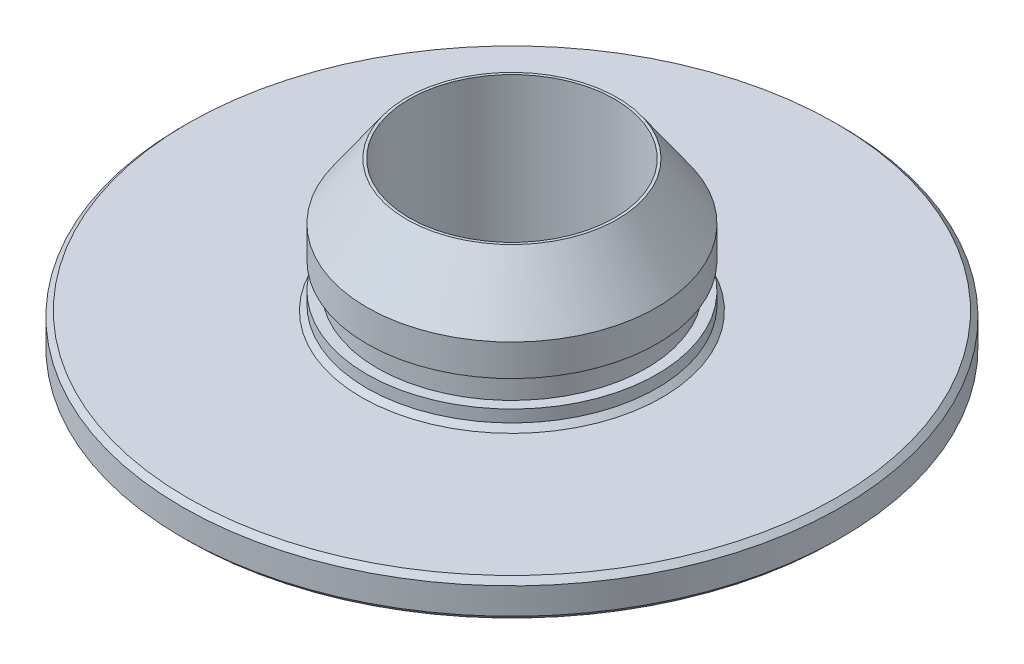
ISO-10303-21;
HEADER;
FILE_DESCRIPTION(('STEP AP214'),'2;1');
FILE_NAME('part.step','',(''),(''),'','','');
FILE_SCHEMA(('AUTOMOTIVE_DESIGN { 1 0 10303 214 1 1 1 1 }'));
ENDSEC;
DATA;
#1=APPLICATION_CONTEXT('core data for automotive mechanical design processes');
#2=APPLICATION_PROTOCOL_DEFINITION('international standard','automotive_design',2000,#1);
#3=PRODUCT_CONTEXT('',#1,'mechanical');
#4=PRODUCT('Part','Part','',(#3));
#5=PRODUCT_RELATED_PRODUCT_CATEGORY('part','',(#4));
#6=PRODUCT_DEFINITION_FORMATION('','',#4);
#7=PRODUCT_DEFINITION_CONTEXT('part definition',#1,'design');
#8=PRODUCT_DEFINITION('design','',#6,#7);
#9=PRODUCT_DEFINITION_SHAPE('','',#8);
#10=(LENGTH_UNIT() NAMED_UNIT(*) SI_UNIT(.MILLI.,.METRE.));
#11=(NAMED_UNIT(*) PLANE_ANGLE_UNIT() SI_UNIT($,.RADIAN.));
#12=(NAMED_UNIT(*) SI_UNIT($,.STERADIAN.) SOLID_ANGLE_UNIT());
#13=UNCERTAINTY_MEASURE_WITH_UNIT(LENGTH_MEASURE(1.E-05),#10,'distance_accuracy_value','');
#14=(GEOMETRIC_REPRESENTATION_CONTEXT(3) GLOBAL_UNCERTAINTY_ASSIGNED_CONTEXT((#13)) GLOBAL_UNIT_ASSIGNED_CONTEXT((#10,
#11,#12)) REPRESENTATION_CONTEXT('',''));
#15=CARTESIAN_POINT('',(0.,0.,0.));
#16=DIRECTION('',(0.,0.,1.));
#17=DIRECTION('',(1.,0.,0.));
#18=AXIS2_PLACEMENT_3D('',#15,#16,#17);
#19=CARTESIAN_POINT('',(0.,1.905,0.));
#20=DIRECTION('',(0.,1.,0.));
#21=DIRECTION('',(0.,0.,1.));
#22=AXIS2_PLACEMENT_3D('',#19,#20,#21);
#23=PLANE('',#22);
#24=CARTESIAN_POINT('',(0.,1.905,0.));
#25=DIRECTION('',(0.,1.,0.));
#26=DIRECTION('',(0.,0.,1.));
#27=AXIS2_PLACEMENT_3D('',#24,#25,#26);
#28=CIRCLE('',#27,3.6195);
#29=CARTESIAN_POINT('',(0.,1.905,3.6195));
#30=VERTEX_POINT('',#29);
#31=EDGE_CURVE('E59',#30,#30,#28,.F.);
#32=ORIENTED_EDGE('',*,*,#31,.T.);
#33=EDGE_LOOP('',(#32));
#34=FACE_BOUND('',#33,.T.);
#35=CARTESIAN_POINT('',(0.,1.905,0.));
#36=DIRECTION('',(0.,1.,0.));
#37=DIRECTION('',(0.,0.,1.));
#38=AXIS2_PLACEMENT_3D('',#35,#36,#37);
#39=CIRCLE('',#38,7.8105);
#40=CARTESIAN_POINT('',(0.,1.905,7.8105));
#41=VERTEX_POINT('',#40);
#42=EDGE_CURVE('E62',#41,#41,#39,.T.);
#43=ORIENTED_EDGE('',*,*,#42,.T.);
#44=EDGE_LOOP('',(#43));
#45=FACE_BOUND('',#44,.T.);
#46=ADVANCED_FACE('F24',(#34,#45),#23,.T.);
#47=CARTESIAN_POINT('',(0.,1.016,0.));
#48=DIRECTION('',(0.,-1.,0.));
#49=DIRECTION('',(0.,0.,-1.));
#50=AXIS2_PLACEMENT_3D('',#47,#48,#49);
#51=CYLINDRICAL_SURFACE('',#50,4.445);
#52=CARTESIAN_POINT('',(0.,0.889000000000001,0.));
#53=DIRECTION('',(0.,1.,0.));
#54=DIRECTION('',(0.,0.,1.));
#55=AXIS2_PLACEMENT_3D('',#52,#53,#54);
#56=CIRCLE('',#55,4.445);
#57=CARTESIAN_POINT('',(0.,0.889000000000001,4.445));
#58=VERTEX_POINT('',#57);
#59=EDGE_CURVE('E39',#58,#58,#56,.F.);
#60=ORIENTED_EDGE('',*,*,#59,.T.);
#61=EDGE_LOOP('',(#60));
#62=FACE_BOUND('',#61,.T.);
#63=CARTESIAN_POINT('',(0.,0.127,0.));
#64=DIRECTION('',(0.,1.,0.));
#65=DIRECTION('',(0.,0.,1.));
#66=AXIS2_PLACEMENT_3D('',#63,#64,#65);
#67=CIRCLE('',#66,4.445);
#68=CARTESIAN_POINT('',(0.,0.127,4.445));
#69=VERTEX_POINT('',#68);
#70=EDGE_CURVE('E44',#69,#69,#67,.T.);
#71=ORIENTED_EDGE('',*,*,#70,.T.);
#72=EDGE_LOOP('',(#71));
#73=FACE_BOUND('',#72,.T.);
#74=ADVANCED_FACE('F26',(#62,#73),#51,.T.);
#75=CARTESIAN_POINT('',(0.,0.,0.));
#76=DIRECTION('',(0.,1.,0.));
#77=DIRECTION('',(0.,0.,1.));
#78=AXIS2_PLACEMENT_3D('',#75,#76,#77);
#79=PLANE('',#78);
#80=CARTESIAN_POINT('',(0.,0.,0.));
#81=DIRECTION('',(0.,1.,0.));
#82=DIRECTION('',(0.,0.,1.));
#83=AXIS2_PLACEMENT_3D('',#80,#81,#82);
#84=CIRCLE('',#83,4.318);
#85=CARTESIAN_POINT('',(0.,0.,4.318));
#86=VERTEX_POINT('',#85);
#87=EDGE_CURVE('E31',#86,#86,#84,.F.);
#88=ORIENTED_EDGE('',*,*,#87,.T.);
#89=EDGE_LOOP('',(#88));
#90=FACE_BOUND('',#89,.T.);
#91=CARTESIAN_POINT('',(0.,0.,0.));
#92=DIRECTION('',(0.,1.,0.));
#93=DIRECTION('',(0.,0.,1.));
#94=AXIS2_PLACEMENT_3D('',#91,#92,#93);
#95=CIRCLE('',#94,2.6035);
#96=CARTESIAN_POINT('',(0.,0.,2.6035));
#97=VERTEX_POINT('',#96);
#98=EDGE_CURVE('E35',#97,#97,#95,.T.);
#99=ORIENTED_EDGE('',*,*,#98,.T.);
#100=EDGE_LOOP('',(#99));
#101=FACE_BOUND('',#100,.T.);
#102=ADVANCED_FACE('F126',(#90,#101),#79,.F.);
#103=CARTESIAN_POINT('',(0.,1.016,0.));
#104=DIRECTION('',(0.,1.,0.));
#105=DIRECTION('',(0.,0.,1.));
#106=AXIS2_PLACEMENT_3D('',#103,#104,#105);
#107=PLANE('',#106);
#108=CARTESIAN_POINT('',(0.,1.016,0.));
#109=DIRECTION('',(0.,1.,0.));
#110=DIRECTION('',(0.,0.,1.));
#111=AXIS2_PLACEMENT_3D('',#108,#109,#110);
#112=CIRCLE('',#111,7.8105);
#113=CARTESIAN_POINT('',(0.,1.016,7.8105));
#114=VERTEX_POINT('',#113);
#115=EDGE_CURVE('E47',#114,#114,#112,.F.);
#116=ORIENTED_EDGE('',*,*,#115,.T.);
#117=EDGE_LOOP('',(#116));
#118=FACE_BOUND('',#117,.T.);
#119=CARTESIAN_POINT('',(0.,1.016,0.));
#120=DIRECTION('',(0.,1.,0.));
#121=DIRECTION('',(0.,0.,1.));
#122=AXIS2_PLACEMENT_3D('',#119,#120,#121);
#123=CIRCLE('',#122,4.572);
#124=CARTESIAN_POINT('',(0.,1.016,4.572));
#125=VERTEX_POINT('',#124);
#126=EDGE_CURVE('E50',#125,#125,#123,.T.);
#127=ORIENTED_EDGE('',*,*,#126,.T.);
#128=EDGE_LOOP('',(#127));
#129=FACE_BOUND('',#128,.T.);
#130=ADVANCED_FACE('F130',(#118,#129),#107,.F.);
#131=CARTESIAN_POINT('',(0.,1.905,0.));
#132=DIRECTION('',(0.,-1.,0.));
#133=DIRECTION('',(0.,0.,-1.));
#134=AXIS2_PLACEMENT_3D('',#131,#132,#133);
#135=CYLINDRICAL_SURFACE('',#134,7.9375);
#136=CARTESIAN_POINT('',(0.,1.778,0.));
#137=DIRECTION('',(0.,1.,0.));
#138=DIRECTION('',(0.,0.,1.));
#139=AXIS2_PLACEMENT_3D('',#136,#137,#138);
#140=CIRCLE('',#139,7.9375);
#141=CARTESIAN_POINT('',(0.,1.778,7.9375));
#142=VERTEX_POINT('',#141);
#143=EDGE_CURVE('E53',#142,#142,#140,.F.);
#144=ORIENTED_EDGE('',*,*,#143,.T.);
#145=EDGE_LOOP('',(#144));
#146=FACE_BOUND('',#145,.T.);
#147=CARTESIAN_POINT('',(0.,1.143,0.));
#148=DIRECTION('',(0.,1.,0.));
#149=DIRECTION('',(0.,0.,1.));
#150=AXIS2_PLACEMENT_3D('',#147,#148,#149);
#151=CIRCLE('',#150,7.9375);
#152=CARTESIAN_POINT('',(0.,1.143,7.9375));
#153=VERTEX_POINT('',#152);
#154=EDGE_CURVE('E56',#153,#153,#151,.T.);
#155=ORIENTED_EDGE('',*,*,#154,.T.);
#156=EDGE_LOOP('',(#155));
#157=FACE_BOUND('',#156,.T.);
#158=ADVANCED_FACE('F118',(#146,#157),#135,.T.);
#159=CARTESIAN_POINT('',(0.,5.08,0.));
#160=DIRECTION('',(0.,-1.,0.));
#161=DIRECTION('',(0.,0.,-1.));
#162=AXIS2_PLACEMENT_3D('',#159,#160,#161);
#163=CYLINDRICAL_SURFACE('',#162,3.4925);
#164=CARTESIAN_POINT('',(0.,2.032,0.));
#165=DIRECTION('',(0.,1.,0.));
#166=DIRECTION('',(0.,0.,1.));
#167=AXIS2_PLACEMENT_3D('',#164,#165,#166);
#168=CIRCLE('',#167,3.4925);
#169=CARTESIAN_POINT('',(0.,2.032,3.4925));
#170=VERTEX_POINT('',#169);
#171=EDGE_CURVE('E65',#170,#170,#168,.T.);
#172=ORIENTED_EDGE('',*,*,#171,.T.);
#173=EDGE_LOOP('',(#172));
#174=FACE_BOUND('',#173,.T.);
#175=CARTESIAN_POINT('',(0.,2.32268902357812,0.));
#176=DIRECTION('',(0.,1.,0.));
#177=DIRECTION('',(0.,0.,1.));
#178=AXIS2_PLACEMENT_3D('',#175,#176,#177);
#179=CIRCLE('',#178,3.4925);
#180=CARTESIAN_POINT('',(0.,2.32268902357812,3.4925));
#181=VERTEX_POINT('',#180);
#182=EDGE_CURVE('E80',#181,#181,#179,.T.);
#183=ORIENTED_EDGE('',*,*,#182,.F.);
#184=EDGE_LOOP('',(#183));
#185=FACE_BOUND('',#184,.T.);
#186=ADVANCED_FACE('F109',(#174,#185),#163,.T.);
#187=CARTESIAN_POINT('',(-3.2385,2.95768902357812,0.));
#188=DIRECTION('',(0.,1.,0.));
#189=DIRECTION('',(0.,0.,1.));
#190=AXIS2_PLACEMENT_3D('',#187,#188,#189);
#191=PLANE('',#190);
#192=CARTESIAN_POINT('',(0.,2.95768902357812,0.));
#193=DIRECTION('',(0.,1.,0.));
#194=DIRECTION('',(0.,0.,1.));
#195=AXIS2_PLACEMENT_3D('',#192,#193,#194);
#196=CIRCLE('',#195,3.4925);
#197=CARTESIAN_POINT('',(0.,2.95768902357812,3.4925));
#198=VERTEX_POINT('',#197);
#199=EDGE_CURVE('E83',#198,#198,#196,.T.);
#200=ORIENTED_EDGE('',*,*,#199,.F.);
#201=EDGE_LOOP('',(#200));
#202=FACE_BOUND('',#201,.T.);
#203=CARTESIAN_POINT('',(0.,2.95768902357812,0.));
#204=DIRECTION('',(0.,1.,0.));
#205=DIRECTION('',(0.,0.,1.));
#206=AXIS2_PLACEMENT_3D('',#203,#204,#205);
#207=CIRCLE('',#206,3.2385);
#208=CARTESIAN_POINT('',(0.,2.95768902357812,3.2385));
#209=VERTEX_POINT('',#208);
#210=EDGE_CURVE('E74',#209,#209,#207,.T.);
#211=ORIENTED_EDGE('',*,*,#210,.T.);
#212=EDGE_LOOP('',(#211));
#213=FACE_BOUND('',#212,.T.);
#214=ADVANCED_FACE('F117',(#202,#213),#191,.F.);
#215=CARTESIAN_POINT('',(0.,5.08,0.));
#216=DIRECTION('',(0.,1.,0.));
#217=DIRECTION('',(0.,0.,1.));
#218=AXIS2_PLACEMENT_3D('',#215,#216,#217);
#219=CYLINDRICAL_SURFACE('',#218,3.2385);
#220=ORIENTED_EDGE('',*,*,#210,.F.);
#221=EDGE_LOOP('',(#220));
#222=FACE_BOUND('',#221,.T.);
#223=CARTESIAN_POINT('',(0.,2.32268902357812,0.));
#224=DIRECTION('',(0.,1.,0.));
#225=DIRECTION('',(0.,0.,1.));
#226=AXIS2_PLACEMENT_3D('',#223,#224,#225);
#227=CIRCLE('',#226,3.2385);
#228=CARTESIAN_POINT('',(0.,2.32268902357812,3.2385));
#229=VERTEX_POINT('',#228);
#230=EDGE_CURVE('E77',#229,#229,#227,.T.);
#231=ORIENTED_EDGE('',*,*,#230,.T.);
#232=EDGE_LOOP('',(#231));
#233=FACE_BOUND('',#232,.T.);
#234=ADVANCED_FACE('F169',(#222,#233),#219,.T.);
#235=CARTESIAN_POINT('',(-3.4925,2.32268902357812,0.));
#236=DIRECTION('',(0.,-1.,0.));
#237=DIRECTION('',(0.,0.,-1.));
#238=AXIS2_PLACEMENT_3D('',#235,#236,#237);
#239=PLANE('',#238);
#240=ORIENTED_EDGE('',*,*,#230,.F.);
#241=EDGE_LOOP('',(#240));
#242=FACE_BOUND('',#241,.T.);
#243=ORIENTED_EDGE('',*,*,#182,.T.);
#244=EDGE_LOOP('',(#243));
#245=FACE_BOUND('',#244,.T.);
#246=ADVANCED_FACE('F96',(#242,#245),#239,.F.);
#247=CARTESIAN_POINT('',(0.,5.08,0.));
#248=DIRECTION('',(0.,1.,0.));
#249=DIRECTION('',(0.,0.,1.));
#250=AXIS2_PLACEMENT_3D('',#247,#248,#249);
#251=PLANE('',#250);
#252=CARTESIAN_POINT('',(0.,5.08,0.));
#253=DIRECTION('',(0.,1.,0.));
#254=DIRECTION('',(0.,0.,1.));
#255=AXIS2_PLACEMENT_3D('',#252,#253,#254);
#256=CIRCLE('',#255,2.4765);
#257=CARTESIAN_POINT('',(0.,5.08,2.4765));
#258=VERTEX_POINT('',#257);
#259=EDGE_CURVE('E86',#258,#258,#256,.T.);
#260=ORIENTED_EDGE('',*,*,#259,.F.);
#261=EDGE_LOOP('',(#260));
#262=FACE_BOUND('',#261,.T.);
#263=CARTESIAN_POINT('',(0.,5.08,0.));
#264=DIRECTION('',(0.,1.,0.));
#265=DIRECTION('',(0.,0.,1.));
#266=AXIS2_PLACEMENT_3D('',#263,#264,#265);
#267=CIRCLE('',#266,2.54);
#268=CARTESIAN_POINT('',(0.,5.08,2.54));
#269=VERTEX_POINT('',#268);
#270=EDGE_CURVE('E71',#269,#269,#267,.T.);
#271=ORIENTED_EDGE('',*,*,#270,.T.);
#272=EDGE_LOOP('',(#271));
#273=FACE_BOUND('',#272,.T.);
#274=ADVANCED_FACE('F92',(#262,#273),#251,.T.);
#275=CARTESIAN_POINT('',(0.,3.71968902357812,0.));
#276=DIRECTION('',(0.,-1.,0.));
#277=DIRECTION('',(0.,0.,-1.));
#278=AXIS2_PLACEMENT_3D('',#275,#276,#277);
#279=CONICAL_SURFACE('',#278,3.4925,0.61086523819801);
#280=ORIENTED_EDGE('',*,*,#270,.F.);
#281=EDGE_LOOP('',(#280));
#282=FACE_BOUND('',#281,.T.);
#283=CARTESIAN_POINT('',(0.,3.71968902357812,0.));
#284=DIRECTION('',(0.,1.,0.));
#285=DIRECTION('',(0.,0.,1.));
#286=AXIS2_PLACEMENT_3D('',#283,#284,#285);
#287=CIRCLE('',#286,3.4925);
#288=CARTESIAN_POINT('',(0.,3.71968902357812,3.4925));
#289=VERTEX_POINT('',#288);
#290=EDGE_CURVE('E68',#289,#289,#287,.T.);
#291=ORIENTED_EDGE('',*,*,#290,.T.);
#292=EDGE_LOOP('',(#291));
#293=FACE_BOUND('',#292,.T.);
#294=ADVANCED_FACE('F95',(#282,#293),#279,.T.);
#295=ORIENTED_EDGE('',*,*,#199,.T.);
#296=EDGE_LOOP('',(#295));
#297=FACE_BOUND('',#296,.T.);
#298=ORIENTED_EDGE('',*,*,#290,.F.);
#299=EDGE_LOOP('',(#298));
#300=FACE_BOUND('',#299,.T.);
#301=ADVANCED_FACE('F102',(#297,#300),#163,.T.);
#302=CARTESIAN_POINT('',(0.,0.,0.));
#303=DIRECTION('',(0.,1.,0.));
#304=DIRECTION('',(0.,0.,1.));
#305=AXIS2_PLACEMENT_3D('',#302,#303,#304);
#306=CYLINDRICAL_SURFACE('',#305,2.4765);
#307=CARTESIAN_POINT('',(0.,0.127,0.));
#308=DIRECTION('',(0.,1.,0.));
#309=DIRECTION('',(0.,0.,1.));
#310=AXIS2_PLACEMENT_3D('',#307,#308,#309);
#311=CIRCLE('',#310,2.4765);
#312=CARTESIAN_POINT('',(0.,0.127,2.4765));
#313=VERTEX_POINT('',#312);
#314=EDGE_CURVE('E10',#313,#313,#311,.F.);
#315=ORIENTED_EDGE('',*,*,#314,.T.);
#316=EDGE_LOOP('',(#315));
#317=FACE_BOUND('',#316,.T.);
#318=ORIENTED_EDGE('',*,*,#259,.T.);
#319=EDGE_LOOP('',(#318));
#320=FACE_BOUND('',#319,.T.);
#321=ADVANCED_FACE('F90',(#317,#320),#306,.F.);
#322=CARTESIAN_POINT('',(0.,2.032,0.));
#323=DIRECTION('',(0.,-1.,0.));
#324=DIRECTION('',(0.,0.,-1.));
#325=AXIS2_PLACEMENT_3D('',#322,#323,#324);
#326=CONICAL_SURFACE('',#325,3.4925,0.785398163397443);
#327=ORIENTED_EDGE('',*,*,#31,.F.);
#328=EDGE_LOOP('',(#327));
#329=FACE_BOUND('',#328,.T.);
#330=ORIENTED_EDGE('',*,*,#171,.F.);
#331=EDGE_LOOP('',(#330));
#332=FACE_BOUND('',#331,.T.);
#333=ADVANCED_FACE('F113',(#329,#332),#326,.T.);
#334=CARTESIAN_POINT('',(0.,1.905,0.));
#335=DIRECTION('',(0.,-1.,0.));
#336=DIRECTION('',(0.,0.,-1.));
#337=AXIS2_PLACEMENT_3D('',#334,#335,#336);
#338=CONICAL_SURFACE('',#337,7.8105,0.785398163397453);
#339=ORIENTED_EDGE('',*,*,#143,.F.);
#340=EDGE_LOOP('',(#339));
#341=FACE_BOUND('',#340,.T.);
#342=ORIENTED_EDGE('',*,*,#42,.F.);
#343=EDGE_LOOP('',(#342));
#344=FACE_BOUND('',#343,.T.);
#345=ADVANCED_FACE('F159',(#341,#344),#338,.T.);
#346=CARTESIAN_POINT('',(0.,1.143,0.));
#347=DIRECTION('',(0.,1.,0.));
#348=DIRECTION('',(0.,0.,1.));
#349=AXIS2_PLACEMENT_3D('',#346,#347,#348);
#350=CONICAL_SURFACE('',#349,7.9375,0.785398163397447);
#351=ORIENTED_EDGE('',*,*,#115,.F.);
#352=EDGE_LOOP('',(#351));
#353=FACE_BOUND('',#352,.T.);
#354=ORIENTED_EDGE('',*,*,#154,.F.);
#355=EDGE_LOOP('',(#354));
#356=FACE_BOUND('',#355,.T.);
#357=ADVANCED_FACE('F155',(#353,#356),#350,.T.);
#358=CARTESIAN_POINT('',(0.,1.016,0.));
#359=DIRECTION('',(0.,1.,0.));
#360=DIRECTION('',(0.,0.,1.));
#361=AXIS2_PLACEMENT_3D('',#358,#359,#360);
#362=CONICAL_SURFACE('',#361,4.572,0.785398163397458);
#363=ORIENTED_EDGE('',*,*,#59,.F.);
#364=EDGE_LOOP('',(#363));
#365=FACE_BOUND('',#364,.T.);
#366=ORIENTED_EDGE('',*,*,#126,.F.);
#367=EDGE_LOOP('',(#366));
#368=FACE_BOUND('',#367,.T.);
#369=ADVANCED_FACE('F149',(#365,#368),#362,.T.);
#370=CARTESIAN_POINT('',(0.,0.127,0.));
#371=DIRECTION('',(0.,1.,0.));
#372=DIRECTION('',(0.,0.,1.));
#373=AXIS2_PLACEMENT_3D('',#370,#371,#372);
#374=CONICAL_SURFACE('',#373,4.445,0.785398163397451);
#375=ORIENTED_EDGE('',*,*,#87,.F.);
#376=EDGE_LOOP('',(#375));
#377=FACE_BOUND('',#376,.T.);
#378=ORIENTED_EDGE('',*,*,#70,.F.);
#379=EDGE_LOOP('',(#378));
#380=FACE_BOUND('',#379,.T.);
#381=ADVANCED_FACE('F143',(#377,#380),#374,.T.);
#382=CARTESIAN_POINT('',(0.,0.,0.));
#383=DIRECTION('',(0.,-1.,0.));
#384=DIRECTION('',(0.,0.,-1.));
#385=AXIS2_PLACEMENT_3D('',#382,#383,#384);
#386=CONICAL_SURFACE('',#385,2.6035,0.785398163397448);
#387=ORIENTED_EDGE('',*,*,#314,.F.);
#388=EDGE_LOOP('',(#387));
#389=FACE_BOUND('',#388,.T.);
#390=ORIENTED_EDGE('',*,*,#98,.F.);
#391=EDGE_LOOP('',(#390));
#392=FACE_BOUND('',#391,.T.);
#393=ADVANCED_FACE('F141',(#389,#392),#386,.F.);
#394=CLOSED_SHELL('',(#46,#74,#102,#130,#158,#186,#214,#234,#246,#274,#294,#301,#321,#333,#345,
#357,#369,#381,#393));
#395=MANIFOLD_SOLID_BREP('B2',#394);
#396=ADVANCED_BREP_SHAPE_REPRESENTATION('',(#18,#395),#14);
#397=SHAPE_DEFINITION_REPRESENTATION(#9,#396);
ENDSEC;
END-ISO-10303-21;
